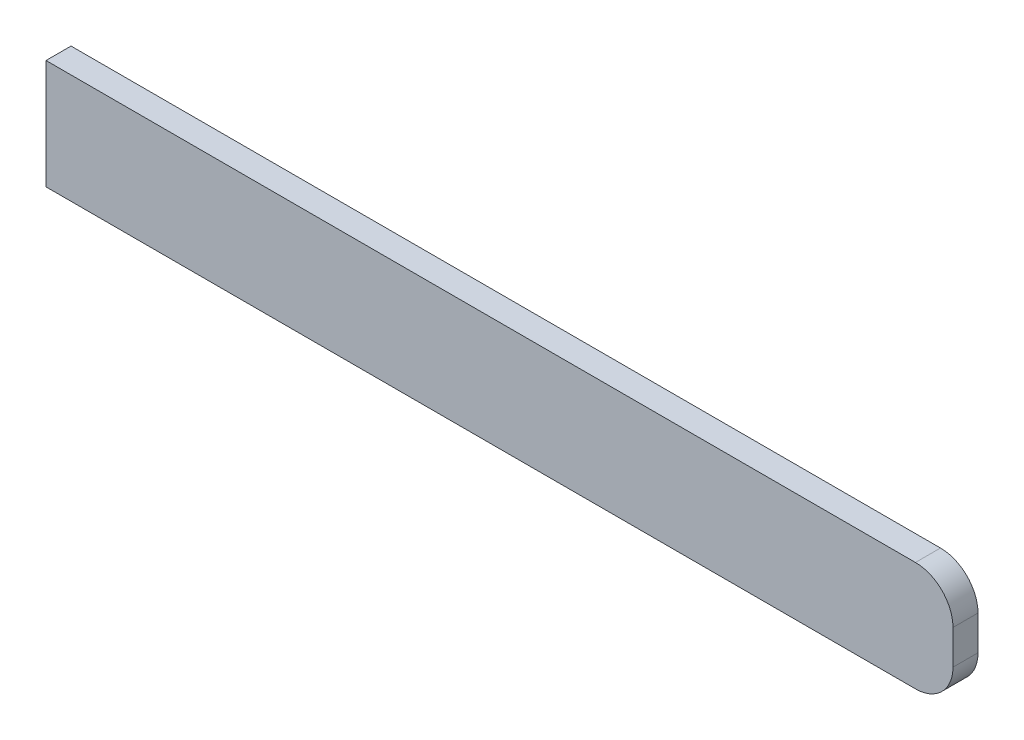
ISO-10303-21;
HEADER;
FILE_DESCRIPTION(('STEP AP214'),'2;1');
FILE_NAME('part.step','',(''),(''),'','','');
FILE_SCHEMA(('AUTOMOTIVE_DESIGN { 1 0 10303 214 1 1 1 1 }'));
ENDSEC;
DATA;
#1=APPLICATION_CONTEXT('core data for automotive mechanical design processes');
#2=APPLICATION_PROTOCOL_DEFINITION('international standard','automotive_design',2000,#1);
#3=PRODUCT_CONTEXT('',#1,'mechanical');
#4=PRODUCT('Part','Part','',(#3));
#5=PRODUCT_RELATED_PRODUCT_CATEGORY('part','',(#4));
#6=PRODUCT_DEFINITION_FORMATION('','',#4);
#7=PRODUCT_DEFINITION_CONTEXT('part definition',#1,'design');
#8=PRODUCT_DEFINITION('design','',#6,#7);
#9=PRODUCT_DEFINITION_SHAPE('','',#8);
#10=(LENGTH_UNIT() NAMED_UNIT(*) SI_UNIT(.MILLI.,.METRE.));
#11=(NAMED_UNIT(*) PLANE_ANGLE_UNIT() SI_UNIT($,.RADIAN.));
#12=(NAMED_UNIT(*) SI_UNIT($,.STERADIAN.) SOLID_ANGLE_UNIT());
#13=UNCERTAINTY_MEASURE_WITH_UNIT(LENGTH_MEASURE(1.E-05),#10,'distance_accuracy_value','');
#14=(GEOMETRIC_REPRESENTATION_CONTEXT(3) GLOBAL_UNCERTAINTY_ASSIGNED_CONTEXT((#13)) GLOBAL_UNIT_ASSIGNED_CONTEXT((#10,
#11,#12)) REPRESENTATION_CONTEXT('',''));
#15=CARTESIAN_POINT('',(0.,0.,0.));
#16=DIRECTION('',(0.,0.,1.));
#17=DIRECTION('',(1.,0.,0.));
#18=AXIS2_PLACEMENT_3D('',#15,#16,#17);
#19=CARTESIAN_POINT('',(-145.,17.5,8.));
#20=DIRECTION('',(1.,0.,0.));
#21=DIRECTION('',(0.,0.,-1.));
#22=AXIS2_PLACEMENT_3D('',#19,#20,#21);
#23=PLANE('',#22);
#24=DIRECTION('',(0.,-1.,0.));
#25=VECTOR('',#24,1.);
#26=CARTESIAN_POINT('',(-145.,17.5,0.));
#27=LINE('',#26,#25);
#28=CARTESIAN_POINT('',(-145.,17.5,0.));
#29=VERTEX_POINT('',#28);
#30=CARTESIAN_POINT('',(-145.,-17.5,0.));
#31=VERTEX_POINT('',#30);
#32=EDGE_CURVE('E114',#29,#31,#27,.T.);
#33=ORIENTED_EDGE('',*,*,#32,.T.);
#34=DIRECTION('',(0.,0.,-1.));
#35=VECTOR('',#34,1.);
#36=CARTESIAN_POINT('',(-145.,-17.5,8.));
#37=LINE('',#36,#35);
#38=CARTESIAN_POINT('',(-145.,-17.5,8.));
#39=VERTEX_POINT('',#38);
#40=EDGE_CURVE('E98',#39,#31,#37,.T.);
#41=ORIENTED_EDGE('',*,*,#40,.F.);
#42=DIRECTION('',(0.,-1.,0.));
#43=VECTOR('',#42,1.);
#44=CARTESIAN_POINT('',(-145.,17.5,8.));
#45=LINE('',#44,#43);
#46=CARTESIAN_POINT('',(-145.,17.5,8.));
#47=VERTEX_POINT('',#46);
#48=EDGE_CURVE('E105',#47,#39,#45,.T.);
#49=ORIENTED_EDGE('',*,*,#48,.F.);
#50=DIRECTION('',(0.,0.,-1.));
#51=VECTOR('',#50,1.);
#52=CARTESIAN_POINT('',(-145.,17.5,8.));
#53=LINE('',#52,#51);
#54=EDGE_CURVE('E113',#47,#29,#53,.T.);
#55=ORIENTED_EDGE('',*,*,#54,.T.);
#56=EDGE_LOOP('',(#33,#41,#49,#55));
#57=FACE_BOUND('',#56,.T.);
#58=ADVANCED_FACE('F41',(#57),#23,.F.);
#59=CARTESIAN_POINT('',(-145.,-17.5,8.));
#60=DIRECTION('',(0.,1.,0.));
#61=DIRECTION('',(0.,0.,1.));
#62=AXIS2_PLACEMENT_3D('',#59,#60,#61);
#63=PLANE('',#62);
#64=DIRECTION('',(1.,0.,0.));
#65=VECTOR('',#64,1.);
#66=CARTESIAN_POINT('',(-145.,-17.5,0.));
#67=LINE('',#66,#65);
#68=CARTESIAN_POINT('',(133.,-17.5,0.));
#69=VERTEX_POINT('',#68);
#70=EDGE_CURVE('E143',#31,#69,#67,.T.);
#71=ORIENTED_EDGE('',*,*,#70,.T.);
#72=DIRECTION('',(0.,0.,-1.));
#73=VECTOR('',#72,1.);
#74=CARTESIAN_POINT('',(133.,-17.5,8.));
#75=LINE('',#74,#73);
#76=CARTESIAN_POINT('',(133.,-17.5,8.));
#77=VERTEX_POINT('',#76);
#78=EDGE_CURVE('E64',#69,#77,#75,.F.);
#79=ORIENTED_EDGE('',*,*,#78,.T.);
#80=DIRECTION('',(1.,0.,0.));
#81=VECTOR('',#80,1.);
#82=CARTESIAN_POINT('',(-145.,-17.5,8.));
#83=LINE('',#82,#81);
#84=EDGE_CURVE('E94',#39,#77,#83,.T.);
#85=ORIENTED_EDGE('',*,*,#84,.F.);
#86=ORIENTED_EDGE('',*,*,#40,.T.);
#87=EDGE_LOOP('',(#71,#79,#85,#86));
#88=FACE_BOUND('',#87,.T.);
#89=ADVANCED_FACE('F96',(#88),#63,.F.);
#90=CARTESIAN_POINT('',(145.,17.5,8.));
#91=DIRECTION('',(-1.,0.,0.));
#92=DIRECTION('',(0.,0.,1.));
#93=AXIS2_PLACEMENT_3D('',#90,#91,#92);
#94=PLANE('',#93);
#95=DIRECTION('',(0.,1.,0.));
#96=VECTOR('',#95,1.);
#97=CARTESIAN_POINT('',(145.,17.5,8.));
#98=LINE('',#97,#96);
#99=CARTESIAN_POINT('',(145.,-5.50000000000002,8.));
#100=VERTEX_POINT('',#99);
#101=CARTESIAN_POINT('',(145.,5.49999999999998,8.));
#102=VERTEX_POINT('',#101);
#103=EDGE_CURVE('E101',#100,#102,#98,.T.);
#104=ORIENTED_EDGE('',*,*,#103,.F.);
#105=DIRECTION('',(0.,0.,-1.));
#106=VECTOR('',#105,1.);
#107=CARTESIAN_POINT('',(145.,-5.50000000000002,8.));
#108=LINE('',#107,#106);
#109=CARTESIAN_POINT('',(145.,-5.50000000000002,0.));
#110=VERTEX_POINT('',#109);
#111=EDGE_CURVE('E120',#100,#110,#108,.T.);
#112=ORIENTED_EDGE('',*,*,#111,.T.);
#113=DIRECTION('',(0.,1.,0.));
#114=VECTOR('',#113,1.);
#115=CARTESIAN_POINT('',(145.,17.5,0.));
#116=LINE('',#115,#114);
#117=CARTESIAN_POINT('',(145.,5.49999999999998,0.));
#118=VERTEX_POINT('',#117);
#119=EDGE_CURVE('E142',#110,#118,#116,.T.);
#120=ORIENTED_EDGE('',*,*,#119,.T.);
#121=DIRECTION('',(0.,0.,-1.));
#122=VECTOR('',#121,1.);
#123=CARTESIAN_POINT('',(145.,5.49999999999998,8.));
#124=LINE('',#123,#122);
#125=EDGE_CURVE('E111',#118,#102,#124,.F.);
#126=ORIENTED_EDGE('',*,*,#125,.T.);
#127=EDGE_LOOP('',(#104,#112,#120,#126));
#128=FACE_BOUND('',#127,.T.);
#129=ADVANCED_FACE('F134',(#128),#94,.F.);
#130=CARTESIAN_POINT('',(-145.,17.5,8.));
#131=DIRECTION('',(0.,-1.,0.));
#132=DIRECTION('',(0.,0.,-1.));
#133=AXIS2_PLACEMENT_3D('',#130,#131,#132);
#134=PLANE('',#133);
#135=DIRECTION('',(-1.,0.,0.));
#136=VECTOR('',#135,1.);
#137=CARTESIAN_POINT('',(-145.,17.5,8.));
#138=LINE('',#137,#136);
#139=CARTESIAN_POINT('',(133.,17.5,8.));
#140=VERTEX_POINT('',#139);
#141=EDGE_CURVE('E106',#140,#47,#138,.T.);
#142=ORIENTED_EDGE('',*,*,#141,.F.);
#143=DIRECTION('',(0.,0.,-1.));
#144=VECTOR('',#143,1.);
#145=CARTESIAN_POINT('',(133.,17.5,8.));
#146=LINE('',#145,#144);
#147=CARTESIAN_POINT('',(133.,17.5,0.));
#148=VERTEX_POINT('',#147);
#149=EDGE_CURVE('E11',#140,#148,#146,.T.);
#150=ORIENTED_EDGE('',*,*,#149,.T.);
#151=DIRECTION('',(-1.,0.,0.));
#152=VECTOR('',#151,1.);
#153=CARTESIAN_POINT('',(-145.,17.5,0.));
#154=LINE('',#153,#152);
#155=EDGE_CURVE('E109',#148,#29,#154,.T.);
#156=ORIENTED_EDGE('',*,*,#155,.T.);
#157=ORIENTED_EDGE('',*,*,#54,.F.);
#158=EDGE_LOOP('',(#142,#150,#156,#157));
#159=FACE_BOUND('',#158,.T.);
#160=ADVANCED_FACE('F149',(#159),#134,.F.);
#161=CARTESIAN_POINT('',(-145.,-17.5,8.));
#162=DIRECTION('',(0.,0.,1.));
#163=DIRECTION('',(1.,0.,0.));
#164=AXIS2_PLACEMENT_3D('',#161,#162,#163);
#165=PLANE('',#164);
#166=ORIENTED_EDGE('',*,*,#84,.T.);
#167=CARTESIAN_POINT('',(133.,-5.50000000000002,8.));
#168=DIRECTION('',(0.,0.,1.));
#169=DIRECTION('',(1.,0.,0.));
#170=AXIS2_PLACEMENT_3D('',#167,#168,#169);
#171=CIRCLE('',#170,12.);
#172=EDGE_CURVE('E47',#77,#100,#171,.T.);
#173=ORIENTED_EDGE('',*,*,#172,.T.);
#174=ORIENTED_EDGE('',*,*,#103,.T.);
#175=CARTESIAN_POINT('',(133.,5.49999999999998,8.));
#176=DIRECTION('',(0.,0.,1.));
#177=DIRECTION('',(1.,0.,0.));
#178=AXIS2_PLACEMENT_3D('',#175,#176,#177);
#179=CIRCLE('',#178,12.);
#180=EDGE_CURVE('E57',#102,#140,#179,.T.);
#181=ORIENTED_EDGE('',*,*,#180,.T.);
#182=ORIENTED_EDGE('',*,*,#141,.T.);
#183=ORIENTED_EDGE('',*,*,#48,.T.);
#184=EDGE_LOOP('',(#166,#173,#174,#181,#182,#183));
#185=FACE_BOUND('',#184,.T.);
#186=ADVANCED_FACE('F104',(#185),#165,.T.);
#187=CARTESIAN_POINT('',(-145.,-17.5,0.));
#188=DIRECTION('',(0.,0.,1.));
#189=DIRECTION('',(1.,0.,0.));
#190=AXIS2_PLACEMENT_3D('',#187,#188,#189);
#191=PLANE('',#190);
#192=ORIENTED_EDGE('',*,*,#119,.F.);
#193=CARTESIAN_POINT('',(133.,-5.50000000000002,0.));
#194=DIRECTION('',(0.,0.,1.));
#195=DIRECTION('',(1.,0.,0.));
#196=AXIS2_PLACEMENT_3D('',#193,#194,#195);
#197=CIRCLE('',#196,12.);
#198=EDGE_CURVE('E127',#110,#69,#197,.F.);
#199=ORIENTED_EDGE('',*,*,#198,.T.);
#200=ORIENTED_EDGE('',*,*,#70,.F.);
#201=ORIENTED_EDGE('',*,*,#32,.F.);
#202=ORIENTED_EDGE('',*,*,#155,.F.);
#203=CARTESIAN_POINT('',(133.,5.49999999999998,0.));
#204=DIRECTION('',(0.,0.,1.));
#205=DIRECTION('',(1.,0.,0.));
#206=AXIS2_PLACEMENT_3D('',#203,#204,#205);
#207=CIRCLE('',#206,12.);
#208=EDGE_CURVE('E123',#148,#118,#207,.F.);
#209=ORIENTED_EDGE('',*,*,#208,.T.);
#210=EDGE_LOOP('',(#192,#199,#200,#201,#202,#209));
#211=FACE_BOUND('',#210,.T.);
#212=ADVANCED_FACE('F139',(#211),#191,.F.);
#213=CARTESIAN_POINT('',(133.,-5.50000000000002,8.));
#214=DIRECTION('',(0.,0.,-1.));
#215=DIRECTION('',(-1.,0.,0.));
#216=AXIS2_PLACEMENT_3D('',#213,#214,#215);
#217=CYLINDRICAL_SURFACE('',#216,12.);
#218=ORIENTED_EDGE('',*,*,#172,.F.);
#219=ORIENTED_EDGE('',*,*,#78,.F.);
#220=ORIENTED_EDGE('',*,*,#198,.F.);
#221=ORIENTED_EDGE('',*,*,#111,.F.);
#222=EDGE_LOOP('',(#218,#219,#220,#221));
#223=FACE_BOUND('',#222,.T.);
#224=ADVANCED_FACE('F137',(#223),#217,.T.);
#225=CARTESIAN_POINT('',(133.,5.49999999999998,8.));
#226=DIRECTION('',(0.,0.,-1.));
#227=DIRECTION('',(-1.,0.,0.));
#228=AXIS2_PLACEMENT_3D('',#225,#226,#227);
#229=CYLINDRICAL_SURFACE('',#228,12.);
#230=ORIENTED_EDGE('',*,*,#180,.F.);
#231=ORIENTED_EDGE('',*,*,#125,.F.);
#232=ORIENTED_EDGE('',*,*,#208,.F.);
#233=ORIENTED_EDGE('',*,*,#149,.F.);
#234=EDGE_LOOP('',(#230,#231,#232,#233));
#235=FACE_BOUND('',#234,.T.);
#236=ADVANCED_FACE('F43',(#235),#229,.T.);
#237=CLOSED_SHELL('',(#58,#89,#129,#160,#186,#212,#224,#236));
#238=MANIFOLD_SOLID_BREP('B2',#237);
#239=ADVANCED_BREP_SHAPE_REPRESENTATION('',(#18,#238),#14);
#240=SHAPE_DEFINITION_REPRESENTATION(#9,#239);
ENDSEC;
END-ISO-10303-21;
